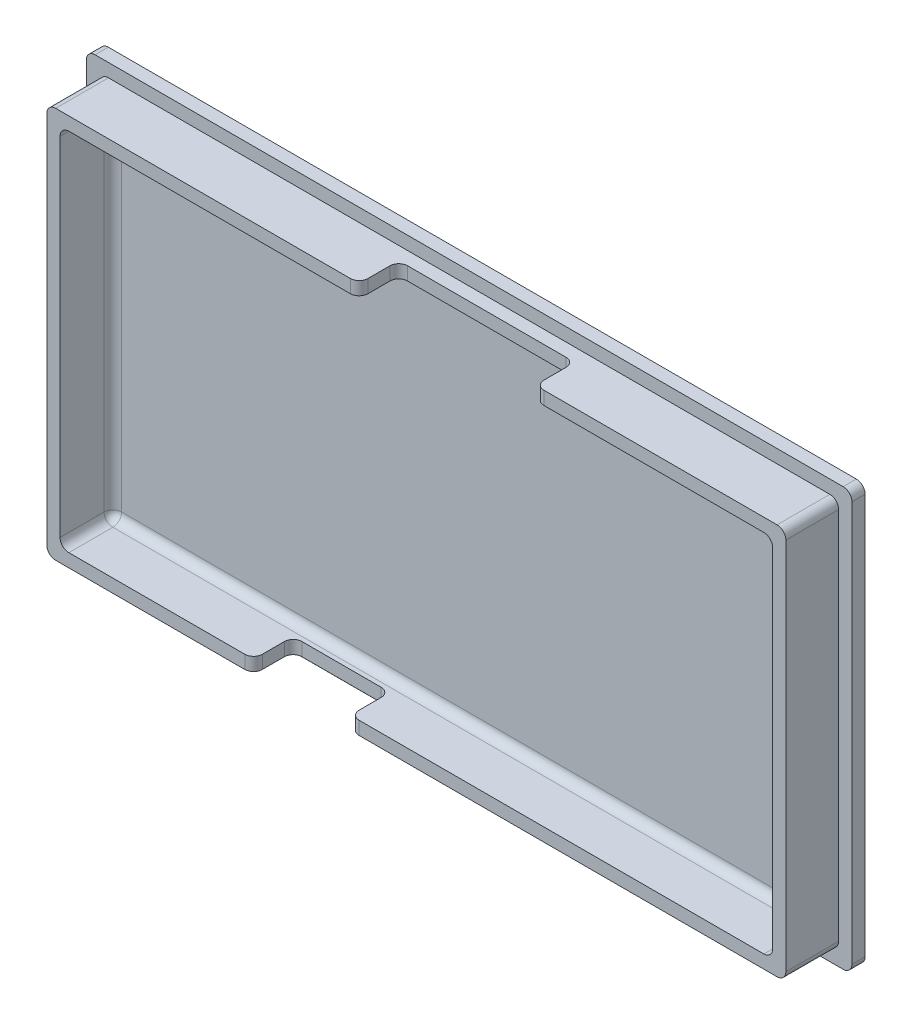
ISO-10303-21;
HEADER;
FILE_DESCRIPTION(('STEP AP214'),'2;1');
FILE_NAME('part.step','',(''),(''),'','','');
FILE_SCHEMA(('AUTOMOTIVE_DESIGN { 1 0 10303 214 1 1 1 1 }'));
ENDSEC;
DATA;
#1=APPLICATION_CONTEXT('core data for automotive mechanical design processes');
#2=APPLICATION_PROTOCOL_DEFINITION('international standard','automotive_design',2000,#1);
#3=PRODUCT_CONTEXT('',#1,'mechanical');
#4=PRODUCT('Part','Part','',(#3));
#5=PRODUCT_RELATED_PRODUCT_CATEGORY('part','',(#4));
#6=PRODUCT_DEFINITION_FORMATION('','',#4);
#7=PRODUCT_DEFINITION_CONTEXT('part definition',#1,'design');
#8=PRODUCT_DEFINITION('design','',#6,#7);
#9=PRODUCT_DEFINITION_SHAPE('','',#8);
#10=(LENGTH_UNIT() NAMED_UNIT(*) SI_UNIT(.MILLI.,.METRE.));
#11=(NAMED_UNIT(*) PLANE_ANGLE_UNIT() SI_UNIT($,.RADIAN.));
#12=(NAMED_UNIT(*) SI_UNIT($,.STERADIAN.) SOLID_ANGLE_UNIT());
#13=UNCERTAINTY_MEASURE_WITH_UNIT(LENGTH_MEASURE(1.E-05),#10,'distance_accuracy_value','');
#14=(GEOMETRIC_REPRESENTATION_CONTEXT(3) GLOBAL_UNCERTAINTY_ASSIGNED_CONTEXT((#13)) GLOBAL_UNIT_ASSIGNED_CONTEXT((#10,
#11,#12)) REPRESENTATION_CONTEXT('',''));
#15=CARTESIAN_POINT('',(0.,0.,0.));
#16=DIRECTION('',(0.,0.,1.));
#17=DIRECTION('',(1.,0.,0.));
#18=AXIS2_PLACEMENT_3D('',#15,#16,#17);
#19=CARTESIAN_POINT('',(0.,0.,7.5));
#20=DIRECTION('',(0.,0.,1.));
#21=DIRECTION('',(1.,0.,0.));
#22=AXIS2_PLACEMENT_3D('',#19,#20,#21);
#23=PLANE('',#22);
#24=DIRECTION('',(1.,0.,0.));
#25=VECTOR('',#24,1.);
#26=CARTESIAN_POINT('',(40.49,-20.74,7.5));
#27=LINE('',#26,#25);
#28=CARTESIAN_POINT('',(-6.49999999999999,-20.74,7.5));
#29=VERTEX_POINT('',#28);
#30=CARTESIAN_POINT('',(39.49,-20.74,7.5));
#31=VERTEX_POINT('',#30);
#32=EDGE_CURVE('E334',#29,#31,#27,.T.);
#33=ORIENTED_EDGE('',*,*,#32,.F.);
#34=DIRECTION('',(0.,1.,0.));
#35=VECTOR('',#34,1.);
#36=CARTESIAN_POINT('',(-6.49999999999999,-22.24,7.5));
#37=LINE('',#36,#35);
#38=CARTESIAN_POINT('',(-6.49999999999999,-22.24,7.5));
#39=VERTEX_POINT('',#38);
#40=EDGE_CURVE('E423',#29,#39,#37,.F.);
#41=ORIENTED_EDGE('',*,*,#40,.T.);
#42=DIRECTION('',(1.,0.,0.));
#43=VECTOR('',#42,1.);
#44=CARTESIAN_POINT('',(41.99,-22.24,7.5));
#45=LINE('',#44,#43);
#46=CARTESIAN_POINT('',(40.99,-22.24,7.5));
#47=VERTEX_POINT('',#46);
#48=EDGE_CURVE('E516',#39,#47,#45,.T.);
#49=ORIENTED_EDGE('',*,*,#48,.T.);
#50=CARTESIAN_POINT('',(40.99,-21.24,7.5));
#51=DIRECTION('',(0.,0.,1.));
#52=DIRECTION('',(1.,0.,0.));
#53=AXIS2_PLACEMENT_3D('',#50,#51,#52);
#54=CIRCLE('',#53,1.);
#55=CARTESIAN_POINT('',(41.99,-21.24,7.5));
#56=VERTEX_POINT('',#55);
#57=EDGE_CURVE('E630',#47,#56,#54,.T.);
#58=ORIENTED_EDGE('',*,*,#57,.T.);
#59=DIRECTION('',(0.,1.,0.));
#60=VECTOR('',#59,1.);
#61=CARTESIAN_POINT('',(41.99,-22.24,7.5));
#62=LINE('',#61,#60);
#63=CARTESIAN_POINT('',(41.99,21.24,7.5));
#64=VERTEX_POINT('',#63);
#65=EDGE_CURVE('E520',#56,#64,#62,.T.);
#66=ORIENTED_EDGE('',*,*,#65,.T.);
#67=CARTESIAN_POINT('',(40.99,21.24,7.5));
#68=DIRECTION('',(0.,0.,1.));
#69=DIRECTION('',(1.,0.,0.));
#70=AXIS2_PLACEMENT_3D('',#67,#68,#69);
#71=CIRCLE('',#70,1.);
#72=CARTESIAN_POINT('',(40.99,22.24,7.5));
#73=VERTEX_POINT('',#72);
#74=EDGE_CURVE('E632',#64,#73,#71,.T.);
#75=ORIENTED_EDGE('',*,*,#74,.T.);
#76=DIRECTION('',(-1.,0.,0.));
#77=VECTOR('',#76,1.);
#78=CARTESIAN_POINT('',(41.99,22.24,7.5));
#79=LINE('',#78,#77);
#80=CARTESIAN_POINT('',(14.5,22.24,7.5));
#81=VERTEX_POINT('',#80);
#82=EDGE_CURVE('E524',#73,#81,#79,.T.);
#83=ORIENTED_EDGE('',*,*,#82,.T.);
#84=DIRECTION('',(0.,1.,0.));
#85=VECTOR('',#84,1.);
#86=CARTESIAN_POINT('',(14.5,20.74,7.5));
#87=LINE('',#86,#85);
#88=CARTESIAN_POINT('',(14.5,20.74,7.5));
#89=VERTEX_POINT('',#88);
#90=EDGE_CURVE('E421',#81,#89,#87,.F.);
#91=ORIENTED_EDGE('',*,*,#90,.T.);
#92=DIRECTION('',(-1.,0.,0.));
#93=VECTOR('',#92,1.);
#94=CARTESIAN_POINT('',(40.49,20.74,7.5));
#95=LINE('',#94,#93);
#96=CARTESIAN_POINT('',(39.49,20.74,7.5));
#97=VERTEX_POINT('',#96);
#98=EDGE_CURVE('E507',#97,#89,#95,.T.);
#99=ORIENTED_EDGE('',*,*,#98,.F.);
#100=CARTESIAN_POINT('',(39.49,19.74,7.5));
#101=DIRECTION('',(0.,0.,1.));
#102=DIRECTION('',(1.,0.,0.));
#103=AXIS2_PLACEMENT_3D('',#100,#101,#102);
#104=CIRCLE('',#103,1.);
#105=CARTESIAN_POINT('',(40.49,19.74,7.5));
#106=VERTEX_POINT('',#105);
#107=EDGE_CURVE('E343',#97,#106,#104,.F.);
#108=ORIENTED_EDGE('',*,*,#107,.T.);
#109=DIRECTION('',(0.,1.,0.));
#110=VECTOR('',#109,1.);
#111=CARTESIAN_POINT('',(40.49,-20.74,7.5));
#112=LINE('',#111,#110);
#113=CARTESIAN_POINT('',(40.49,-19.74,7.5));
#114=VERTEX_POINT('',#113);
#115=EDGE_CURVE('E333',#114,#106,#112,.T.);
#116=ORIENTED_EDGE('',*,*,#115,.F.);
#117=CARTESIAN_POINT('',(39.49,-19.74,7.5));
#118=DIRECTION('',(0.,0.,1.));
#119=DIRECTION('',(1.,0.,0.));
#120=AXIS2_PLACEMENT_3D('',#117,#118,#119);
#121=CIRCLE('',#120,1.);
#122=EDGE_CURVE('E340',#114,#31,#121,.F.);
#123=ORIENTED_EDGE('',*,*,#122,.T.);
#124=EDGE_LOOP('',(#33,#41,#49,#58,#66,#75,#83,#91,#99,#108,#116,#123));
#125=FACE_BOUND('',#124,.T.);
#126=ADVANCED_FACE('F41',(#125),#23,.T.);
#127=CARTESIAN_POINT('',(0.,0.,1.5));
#128=DIRECTION('',(0.,0.,-1.));
#129=DIRECTION('',(-1.,0.,0.));
#130=AXIS2_PLACEMENT_3D('',#127,#128,#129);
#131=PLANE('',#130);
#132=DIRECTION('',(0.,1.,0.));
#133=VECTOR('',#132,1.);
#134=CARTESIAN_POINT('',(43.5,23.75,1.5));
#135=LINE('',#134,#133);
#136=CARTESIAN_POINT('',(43.5,-22.75,1.5));
#137=VERTEX_POINT('',#136);
#138=CARTESIAN_POINT('',(43.5,22.75,1.5));
#139=VERTEX_POINT('',#138);
#140=EDGE_CURVE('E545',#137,#139,#135,.T.);
#141=ORIENTED_EDGE('',*,*,#140,.T.);
#142=CARTESIAN_POINT('',(42.5,22.75,1.5));
#143=DIRECTION('',(0.,0.,-1.));
#144=DIRECTION('',(-1.,0.,0.));
#145=AXIS2_PLACEMENT_3D('',#142,#143,#144);
#146=CIRCLE('',#145,1.);
#147=CARTESIAN_POINT('',(42.5,23.75,1.5));
#148=VERTEX_POINT('',#147);
#149=EDGE_CURVE('E613',#139,#148,#146,.F.);
#150=ORIENTED_EDGE('',*,*,#149,.T.);
#151=DIRECTION('',(-1.,0.,0.));
#152=VECTOR('',#151,1.);
#153=CARTESIAN_POINT('',(43.5,23.75,1.5));
#154=LINE('',#153,#152);
#155=CARTESIAN_POINT('',(-42.5,23.75,1.5));
#156=VERTEX_POINT('',#155);
#157=EDGE_CURVE('E323',#148,#156,#154,.T.);
#158=ORIENTED_EDGE('',*,*,#157,.T.);
#159=CARTESIAN_POINT('',(-42.5,22.75,1.5));
#160=DIRECTION('',(0.,0.,-1.));
#161=DIRECTION('',(-1.,0.,0.));
#162=AXIS2_PLACEMENT_3D('',#159,#160,#161);
#163=CIRCLE('',#162,1.);
#164=CARTESIAN_POINT('',(-43.5,22.75,1.5));
#165=VERTEX_POINT('',#164);
#166=EDGE_CURVE('E607',#156,#165,#163,.F.);
#167=ORIENTED_EDGE('',*,*,#166,.T.);
#168=DIRECTION('',(0.,-1.,0.));
#169=VECTOR('',#168,1.);
#170=CARTESIAN_POINT('',(-43.5,23.75,1.5));
#171=LINE('',#170,#169);
#172=CARTESIAN_POINT('',(-43.5,-22.75,1.5));
#173=VERTEX_POINT('',#172);
#174=EDGE_CURVE('E538',#165,#173,#171,.T.);
#175=ORIENTED_EDGE('',*,*,#174,.T.);
#176=CARTESIAN_POINT('',(-42.5,-22.75,1.5));
#177=DIRECTION('',(0.,0.,-1.));
#178=DIRECTION('',(-1.,0.,0.));
#179=AXIS2_PLACEMENT_3D('',#176,#177,#178);
#180=CIRCLE('',#179,1.);
#181=CARTESIAN_POINT('',(-42.5,-23.75,1.5));
#182=VERTEX_POINT('',#181);
#183=EDGE_CURVE('E609',#173,#182,#180,.F.);
#184=ORIENTED_EDGE('',*,*,#183,.T.);
#185=DIRECTION('',(1.,0.,0.));
#186=VECTOR('',#185,1.);
#187=CARTESIAN_POINT('',(43.5,-23.75,1.5));
#188=LINE('',#187,#186);
#189=CARTESIAN_POINT('',(42.5,-23.75,1.5));
#190=VERTEX_POINT('',#189);
#191=EDGE_CURVE('E541',#182,#190,#188,.T.);
#192=ORIENTED_EDGE('',*,*,#191,.T.);
#193=CARTESIAN_POINT('',(42.5,-22.75,1.5));
#194=DIRECTION('',(0.,0.,-1.));
#195=DIRECTION('',(-1.,0.,0.));
#196=AXIS2_PLACEMENT_3D('',#193,#194,#195);
#197=CIRCLE('',#196,1.);
#198=EDGE_CURVE('E611',#190,#137,#197,.F.);
#199=ORIENTED_EDGE('',*,*,#198,.T.);
#200=EDGE_LOOP('',(#141,#150,#158,#167,#175,#184,#192,#199));
#201=FACE_BOUND('',#200,.T.);
#202=DIRECTION('',(0.,-1.,0.));
#203=VECTOR('',#202,1.);
#204=CARTESIAN_POINT('',(-41.99,-22.24,1.5));
#205=LINE('',#204,#203);
#206=CARTESIAN_POINT('',(-41.99,21.24,1.5));
#207=VERTEX_POINT('',#206);
#208=CARTESIAN_POINT('',(-41.99,-21.24,1.5));
#209=VERTEX_POINT('',#208);
#210=EDGE_CURVE('E509',#207,#209,#205,.T.);
#211=ORIENTED_EDGE('',*,*,#210,.F.);
#212=CARTESIAN_POINT('',(-40.99,21.24,1.5));
#213=DIRECTION('',(0.,0.,-1.));
#214=DIRECTION('',(-1.,0.,0.));
#215=AXIS2_PLACEMENT_3D('',#212,#213,#214);
#216=CIRCLE('',#215,1.);
#217=CARTESIAN_POINT('',(-40.99,22.24,1.5));
#218=VERTEX_POINT('',#217);
#219=EDGE_CURVE('E357',#207,#218,#216,.T.);
#220=ORIENTED_EDGE('',*,*,#219,.T.);
#221=DIRECTION('',(-1.,0.,0.));
#222=VECTOR('',#221,1.);
#223=CARTESIAN_POINT('',(41.99,22.24,1.5));
#224=LINE('',#223,#222);
#225=CARTESIAN_POINT('',(40.99,22.24,1.5));
#226=VERTEX_POINT('',#225);
#227=EDGE_CURVE('E517',#226,#218,#224,.T.);
#228=ORIENTED_EDGE('',*,*,#227,.F.);
#229=CARTESIAN_POINT('',(40.99,21.24,1.5));
#230=DIRECTION('',(0.,0.,-1.));
#231=DIRECTION('',(-1.,0.,0.));
#232=AXIS2_PLACEMENT_3D('',#229,#230,#231);
#233=CIRCLE('',#232,1.);
#234=CARTESIAN_POINT('',(41.99,21.24,1.5));
#235=VERTEX_POINT('',#234);
#236=EDGE_CURVE('E351',#226,#235,#233,.T.);
#237=ORIENTED_EDGE('',*,*,#236,.T.);
#238=DIRECTION('',(0.,1.,0.));
#239=VECTOR('',#238,1.);
#240=CARTESIAN_POINT('',(41.99,-22.24,1.5));
#241=LINE('',#240,#239);
#242=CARTESIAN_POINT('',(41.99,-21.24,1.5));
#243=VERTEX_POINT('',#242);
#244=EDGE_CURVE('E533',#243,#235,#241,.T.);
#245=ORIENTED_EDGE('',*,*,#244,.F.);
#246=CARTESIAN_POINT('',(40.99,-21.24,1.5));
#247=DIRECTION('',(0.,0.,-1.));
#248=DIRECTION('',(-1.,0.,0.));
#249=AXIS2_PLACEMENT_3D('',#246,#247,#248);
#250=CIRCLE('',#249,1.);
#251=CARTESIAN_POINT('',(40.99,-22.24,1.5));
#252=VERTEX_POINT('',#251);
#253=EDGE_CURVE('E353',#243,#252,#250,.T.);
#254=ORIENTED_EDGE('',*,*,#253,.T.);
#255=DIRECTION('',(1.,0.,0.));
#256=VECTOR('',#255,1.);
#257=CARTESIAN_POINT('',(41.99,-22.24,1.5));
#258=LINE('',#257,#256);
#259=CARTESIAN_POINT('',(-40.99,-22.24,1.5));
#260=VERTEX_POINT('',#259);
#261=EDGE_CURVE('E530',#260,#252,#258,.T.);
#262=ORIENTED_EDGE('',*,*,#261,.F.);
#263=CARTESIAN_POINT('',(-40.99,-21.24,1.5));
#264=DIRECTION('',(0.,0.,-1.));
#265=DIRECTION('',(-1.,0.,0.));
#266=AXIS2_PLACEMENT_3D('',#263,#264,#265);
#267=CIRCLE('',#266,1.);
#268=EDGE_CURVE('E355',#260,#209,#267,.T.);
#269=ORIENTED_EDGE('',*,*,#268,.T.);
#270=EDGE_LOOP('',(#211,#220,#228,#237,#245,#254,#262,#269));
#271=FACE_BOUND('',#270,.T.);
#272=ADVANCED_FACE('F661',(#201,#271),#131,.F.);
#273=CARTESIAN_POINT('',(-43.5,23.75,1.5));
#274=DIRECTION('',(1.,0.,0.));
#275=DIRECTION('',(0.,1.,0.));
#276=AXIS2_PLACEMENT_3D('',#273,#274,#275);
#277=PLANE('',#276);
#278=DIRECTION('',(0.,-1.,0.));
#279=VECTOR('',#278,1.);
#280=CARTESIAN_POINT('',(-43.5,23.75,0.));
#281=LINE('',#280,#279);
#282=CARTESIAN_POINT('',(-43.5,22.75,0.));
#283=VERTEX_POINT('',#282);
#284=CARTESIAN_POINT('',(-43.5,-22.75,0.));
#285=VERTEX_POINT('',#284);
#286=EDGE_CURVE('E527',#283,#285,#281,.T.);
#287=ORIENTED_EDGE('',*,*,#286,.T.);
#288=DIRECTION('',(0.,0.,-1.));
#289=VECTOR('',#288,1.);
#290=CARTESIAN_POINT('',(-43.5,-22.75,1.5));
#291=LINE('',#290,#289);
#292=EDGE_CURVE('E346',#285,#173,#291,.F.);
#293=ORIENTED_EDGE('',*,*,#292,.T.);
#294=ORIENTED_EDGE('',*,*,#174,.F.);
#295=DIRECTION('',(0.,0.,-1.));
#296=VECTOR('',#295,1.);
#297=CARTESIAN_POINT('',(-43.5,22.75,1.5));
#298=LINE('',#297,#296);
#299=EDGE_CURVE('E650',#165,#283,#298,.T.);
#300=ORIENTED_EDGE('',*,*,#299,.T.);
#301=EDGE_LOOP('',(#287,#293,#294,#300));
#302=FACE_BOUND('',#301,.T.);
#303=ADVANCED_FACE('F655',(#302),#277,.F.);
#304=CARTESIAN_POINT('',(43.5,-23.75,1.5));
#305=DIRECTION('',(0.,1.,0.));
#306=DIRECTION('',(-1.,0.,0.));
#307=AXIS2_PLACEMENT_3D('',#304,#305,#306);
#308=PLANE('',#307);
#309=DIRECTION('',(1.,0.,0.));
#310=VECTOR('',#309,1.);
#311=CARTESIAN_POINT('',(43.5,-23.75,0.));
#312=LINE('',#311,#310);
#313=CARTESIAN_POINT('',(-42.5,-23.75,0.));
#314=VERTEX_POINT('',#313);
#315=CARTESIAN_POINT('',(42.5,-23.75,0.));
#316=VERTEX_POINT('',#315);
#317=EDGE_CURVE('E552',#314,#316,#312,.T.);
#318=ORIENTED_EDGE('',*,*,#317,.T.);
#319=DIRECTION('',(0.,0.,-1.));
#320=VECTOR('',#319,1.);
#321=CARTESIAN_POINT('',(42.5,-23.75,1.5));
#322=LINE('',#321,#320);
#323=EDGE_CURVE('E637',#316,#190,#322,.F.);
#324=ORIENTED_EDGE('',*,*,#323,.T.);
#325=ORIENTED_EDGE('',*,*,#191,.F.);
#326=DIRECTION('',(0.,0.,-1.));
#327=VECTOR('',#326,1.);
#328=CARTESIAN_POINT('',(-42.5,-23.75,1.5));
#329=LINE('',#328,#327);
#330=EDGE_CURVE('E634',#182,#314,#329,.T.);
#331=ORIENTED_EDGE('',*,*,#330,.T.);
#332=EDGE_LOOP('',(#318,#324,#325,#331));
#333=FACE_BOUND('',#332,.T.);
#334=ADVANCED_FACE('F669',(#333),#308,.F.);
#335=CARTESIAN_POINT('',(43.5,23.75,1.5));
#336=DIRECTION('',(-1.,0.,0.));
#337=DIRECTION('',(0.,-1.,0.));
#338=AXIS2_PLACEMENT_3D('',#335,#336,#337);
#339=PLANE('',#338);
#340=DIRECTION('',(0.,1.,0.));
#341=VECTOR('',#340,1.);
#342=CARTESIAN_POINT('',(43.5,23.75,0.));
#343=LINE('',#342,#341);
#344=CARTESIAN_POINT('',(43.5,-22.75,0.));
#345=VERTEX_POINT('',#344);
#346=CARTESIAN_POINT('',(43.5,22.75,0.));
#347=VERTEX_POINT('',#346);
#348=EDGE_CURVE('E555',#345,#347,#343,.T.);
#349=ORIENTED_EDGE('',*,*,#348,.T.);
#350=DIRECTION('',(0.,0.,-1.));
#351=VECTOR('',#350,1.);
#352=CARTESIAN_POINT('',(43.5,22.75,1.5));
#353=LINE('',#352,#351);
#354=EDGE_CURVE('E605',#347,#139,#353,.F.);
#355=ORIENTED_EDGE('',*,*,#354,.T.);
#356=ORIENTED_EDGE('',*,*,#140,.F.);
#357=DIRECTION('',(0.,0.,-1.));
#358=VECTOR('',#357,1.);
#359=CARTESIAN_POINT('',(43.5,-22.75,1.5));
#360=LINE('',#359,#358);
#361=EDGE_CURVE('E602',#137,#345,#360,.T.);
#362=ORIENTED_EDGE('',*,*,#361,.T.);
#363=EDGE_LOOP('',(#349,#355,#356,#362));
#364=FACE_BOUND('',#363,.T.);
#365=ADVANCED_FACE('F681',(#364),#339,.F.);
#366=CARTESIAN_POINT('',(43.5,23.75,1.5));
#367=DIRECTION('',(0.,-1.,0.));
#368=DIRECTION('',(1.,0.,0.));
#369=AXIS2_PLACEMENT_3D('',#366,#367,#368);
#370=PLANE('',#369);
#371=ORIENTED_EDGE('',*,*,#157,.F.);
#372=DIRECTION('',(0.,0.,-1.));
#373=VECTOR('',#372,1.);
#374=CARTESIAN_POINT('',(42.5,23.75,1.5));
#375=LINE('',#374,#373);
#376=CARTESIAN_POINT('',(42.5,23.75,0.));
#377=VERTEX_POINT('',#376);
#378=EDGE_CURVE('E591',#148,#377,#375,.T.);
#379=ORIENTED_EDGE('',*,*,#378,.T.);
#380=DIRECTION('',(-1.,0.,0.));
#381=VECTOR('',#380,1.);
#382=CARTESIAN_POINT('',(43.5,23.75,0.));
#383=LINE('',#382,#381);
#384=CARTESIAN_POINT('',(-42.5,23.75,0.));
#385=VERTEX_POINT('',#384);
#386=EDGE_CURVE('E542',#377,#385,#383,.T.);
#387=ORIENTED_EDGE('',*,*,#386,.T.);
#388=DIRECTION('',(0.,0.,-1.));
#389=VECTOR('',#388,1.);
#390=CARTESIAN_POINT('',(-42.5,23.75,1.5));
#391=LINE('',#390,#389);
#392=EDGE_CURVE('E589',#385,#156,#391,.F.);
#393=ORIENTED_EDGE('',*,*,#392,.T.);
#394=EDGE_LOOP('',(#371,#379,#387,#393));
#395=FACE_BOUND('',#394,.T.);
#396=ADVANCED_FACE('F689',(#395),#370,.F.);
#397=CARTESIAN_POINT('',(0.,0.,0.));
#398=DIRECTION('',(0.,0.,-1.));
#399=DIRECTION('',(-1.,0.,0.));
#400=AXIS2_PLACEMENT_3D('',#397,#398,#399);
#401=PLANE('',#400);
#402=ORIENTED_EDGE('',*,*,#386,.F.);
#403=CARTESIAN_POINT('',(42.5,22.75,0.));
#404=DIRECTION('',(0.,0.,-1.));
#405=DIRECTION('',(-1.,0.,0.));
#406=AXIS2_PLACEMENT_3D('',#403,#404,#405);
#407=CIRCLE('',#406,1.);
#408=EDGE_CURVE('E600',#377,#347,#407,.T.);
#409=ORIENTED_EDGE('',*,*,#408,.T.);
#410=ORIENTED_EDGE('',*,*,#348,.F.);
#411=CARTESIAN_POINT('',(42.5,-22.75,0.));
#412=DIRECTION('',(0.,0.,-1.));
#413=DIRECTION('',(-1.,0.,0.));
#414=AXIS2_PLACEMENT_3D('',#411,#412,#413);
#415=CIRCLE('',#414,1.);
#416=EDGE_CURVE('E598',#345,#316,#415,.T.);
#417=ORIENTED_EDGE('',*,*,#416,.T.);
#418=ORIENTED_EDGE('',*,*,#317,.F.);
#419=CARTESIAN_POINT('',(-42.5,-22.75,0.));
#420=DIRECTION('',(0.,0.,-1.));
#421=DIRECTION('',(-1.,0.,0.));
#422=AXIS2_PLACEMENT_3D('',#419,#420,#421);
#423=CIRCLE('',#422,1.);
#424=EDGE_CURVE('E596',#314,#285,#423,.T.);
#425=ORIENTED_EDGE('',*,*,#424,.T.);
#426=ORIENTED_EDGE('',*,*,#286,.F.);
#427=CARTESIAN_POINT('',(-42.5,22.75,0.));
#428=DIRECTION('',(0.,0.,-1.));
#429=DIRECTION('',(-1.,0.,0.));
#430=AXIS2_PLACEMENT_3D('',#427,#428,#429);
#431=CIRCLE('',#430,1.);
#432=EDGE_CURVE('E594',#283,#385,#431,.T.);
#433=ORIENTED_EDGE('',*,*,#432,.T.);
#434=EDGE_LOOP('',(#402,#409,#410,#417,#418,#425,#426,#433));
#435=FACE_BOUND('',#434,.T.);
#436=ADVANCED_FACE('F673',(#435),#401,.T.);
#437=CARTESIAN_POINT('',(-40.99,-22.24,7.5));
#438=VERTEX_POINT('',#437);
#439=CARTESIAN_POINT('',(-19.5,-22.24,7.5));
#440=VERTEX_POINT('',#439);
#441=EDGE_CURVE('E518',#438,#440,#45,.T.);
#442=ORIENTED_EDGE('',*,*,#441,.T.);
#443=DIRECTION('',(0.,-1.,0.));
#444=VECTOR('',#443,1.);
#445=CARTESIAN_POINT('',(-19.5,-20.74,7.5));
#446=LINE('',#445,#444);
#447=CARTESIAN_POINT('',(-19.5,-20.74,7.5));
#448=VERTEX_POINT('',#447);
#449=EDGE_CURVE('E332',#440,#448,#446,.F.);
#450=ORIENTED_EDGE('',*,*,#449,.T.);
#451=CARTESIAN_POINT('',(-39.49,-20.74,7.5));
#452=VERTEX_POINT('',#451);
#453=EDGE_CURVE('E314',#452,#448,#27,.T.);
#454=ORIENTED_EDGE('',*,*,#453,.F.);
#455=CARTESIAN_POINT('',(-39.49,-19.74,7.5));
#456=DIRECTION('',(0.,0.,1.));
#457=DIRECTION('',(1.,0.,0.));
#458=AXIS2_PLACEMENT_3D('',#455,#456,#457);
#459=CIRCLE('',#458,1.);
#460=CARTESIAN_POINT('',(-40.49,-19.74,7.5));
#461=VERTEX_POINT('',#460);
#462=EDGE_CURVE('E329',#452,#461,#459,.F.);
#463=ORIENTED_EDGE('',*,*,#462,.T.);
#464=DIRECTION('',(0.,-1.,0.));
#465=VECTOR('',#464,1.);
#466=CARTESIAN_POINT('',(-40.49,-20.74,7.5));
#467=LINE('',#466,#465);
#468=CARTESIAN_POINT('',(-40.49,19.74,7.5));
#469=VERTEX_POINT('',#468);
#470=EDGE_CURVE('E394',#469,#461,#467,.T.);
#471=ORIENTED_EDGE('',*,*,#470,.F.);
#472=CARTESIAN_POINT('',(-39.49,19.74,7.5));
#473=DIRECTION('',(0.,0.,1.));
#474=DIRECTION('',(1.,0.,0.));
#475=AXIS2_PLACEMENT_3D('',#472,#473,#474);
#476=CIRCLE('',#475,1.);
#477=CARTESIAN_POINT('',(-39.49,20.74,7.5));
#478=VERTEX_POINT('',#477);
#479=EDGE_CURVE('E339',#469,#478,#476,.F.);
#480=ORIENTED_EDGE('',*,*,#479,.T.);
#481=CARTESIAN_POINT('',(-7.50000000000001,20.74,7.5));
#482=VERTEX_POINT('',#481);
#483=EDGE_CURVE('E503',#482,#478,#95,.T.);
#484=ORIENTED_EDGE('',*,*,#483,.F.);
#485=DIRECTION('',(0.,-1.,0.));
#486=VECTOR('',#485,1.);
#487=CARTESIAN_POINT('',(-7.5,22.24,7.5));
#488=LINE('',#487,#486);
#489=CARTESIAN_POINT('',(-7.50000000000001,22.24,7.5));
#490=VERTEX_POINT('',#489);
#491=EDGE_CURVE('E440',#482,#490,#488,.F.);
#492=ORIENTED_EDGE('',*,*,#491,.T.);
#493=CARTESIAN_POINT('',(-40.99,22.24,7.5));
#494=VERTEX_POINT('',#493);
#495=EDGE_CURVE('E523',#490,#494,#79,.T.);
#496=ORIENTED_EDGE('',*,*,#495,.T.);
#497=CARTESIAN_POINT('',(-40.99,21.24,7.5));
#498=DIRECTION('',(0.,0.,1.));
#499=DIRECTION('',(1.,0.,0.));
#500=AXIS2_PLACEMENT_3D('',#497,#498,#499);
#501=CIRCLE('',#500,1.);
#502=CARTESIAN_POINT('',(-41.99,21.24,7.5));
#503=VERTEX_POINT('',#502);
#504=EDGE_CURVE('E626',#494,#503,#501,.T.);
#505=ORIENTED_EDGE('',*,*,#504,.T.);
#506=DIRECTION('',(0.,-1.,0.));
#507=VECTOR('',#506,1.);
#508=CARTESIAN_POINT('',(-41.99,-22.24,7.5));
#509=LINE('',#508,#507);
#510=CARTESIAN_POINT('',(-41.99,-21.24,7.5));
#511=VERTEX_POINT('',#510);
#512=EDGE_CURVE('E513',#503,#511,#509,.T.);
#513=ORIENTED_EDGE('',*,*,#512,.T.);
#514=CARTESIAN_POINT('',(-40.99,-21.24,7.5));
#515=DIRECTION('',(0.,0.,1.));
#516=DIRECTION('',(1.,0.,0.));
#517=AXIS2_PLACEMENT_3D('',#514,#515,#516);
#518=CIRCLE('',#517,1.);
#519=EDGE_CURVE('E628',#511,#438,#518,.T.);
#520=ORIENTED_EDGE('',*,*,#519,.T.);
#521=EDGE_LOOP('',(#442,#450,#454,#463,#471,#480,#484,#492,#496,#505,#513,#520));
#522=FACE_BOUND('',#521,.T.);
#523=ADVANCED_FACE('F327',(#522),#23,.T.);
#524=CARTESIAN_POINT('',(-41.99,-22.24,7.5));
#525=DIRECTION('',(1.,0.,0.));
#526=DIRECTION('',(0.,0.,-1.));
#527=AXIS2_PLACEMENT_3D('',#524,#525,#526);
#528=PLANE('',#527);
#529=ORIENTED_EDGE('',*,*,#210,.T.);
#530=DIRECTION('',(0.,0.,-1.));
#531=VECTOR('',#530,1.);
#532=CARTESIAN_POINT('',(-41.99,-21.24,7.5));
#533=LINE('',#532,#531);
#534=EDGE_CURVE('E648',#209,#511,#533,.F.);
#535=ORIENTED_EDGE('',*,*,#534,.T.);
#536=ORIENTED_EDGE('',*,*,#512,.F.);
#537=DIRECTION('',(0.,0.,-1.));
#538=VECTOR('',#537,1.);
#539=CARTESIAN_POINT('',(-41.99,21.24,7.5));
#540=LINE('',#539,#538);
#541=EDGE_CURVE('E645',#503,#207,#540,.T.);
#542=ORIENTED_EDGE('',*,*,#541,.T.);
#543=EDGE_LOOP('',(#529,#535,#536,#542));
#544=FACE_BOUND('',#543,.T.);
#545=ADVANCED_FACE('F718',(#544),#528,.F.);
#546=CARTESIAN_POINT('',(41.99,-22.24,7.5));
#547=DIRECTION('',(0.,1.,0.));
#548=DIRECTION('',(0.,0.,1.));
#549=AXIS2_PLACEMENT_3D('',#546,#547,#548);
#550=PLANE('',#549);
#551=ORIENTED_EDGE('',*,*,#48,.F.);
#552=CARTESIAN_POINT('',(-6.49999999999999,-22.24,6.5));
#553=DIRECTION('',(0.,1.,0.));
#554=DIRECTION('',(0.,0.,1.));
#555=AXIS2_PLACEMENT_3D('',#552,#553,#554);
#556=CIRCLE('',#555,1.);
#557=CARTESIAN_POINT('',(-7.49999999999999,-22.24,6.5));
#558=VERTEX_POINT('',#557);
#559=EDGE_CURVE('E427',#39,#558,#556,.F.);
#560=ORIENTED_EDGE('',*,*,#559,.T.);
#561=DIRECTION('',(0.,0.,-1.));
#562=VECTOR('',#561,1.);
#563=CARTESIAN_POINT('',(-7.49999999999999,-22.24,7.5));
#564=LINE('',#563,#562);
#565=CARTESIAN_POINT('',(-7.49999999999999,-22.24,4.));
#566=VERTEX_POINT('',#565);
#567=EDGE_CURVE('E363',#558,#566,#564,.T.);
#568=ORIENTED_EDGE('',*,*,#567,.T.);
#569=CARTESIAN_POINT('',(-8.49999999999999,-22.24,4.));
#570=DIRECTION('',(0.,1.,0.));
#571=DIRECTION('',(0.,0.,1.));
#572=AXIS2_PLACEMENT_3D('',#569,#570,#571);
#573=CIRCLE('',#572,1.);
#574=CARTESIAN_POINT('',(-8.49999999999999,-22.24,3.));
#575=VERTEX_POINT('',#574);
#576=EDGE_CURVE('E467',#566,#575,#573,.T.);
#577=ORIENTED_EDGE('',*,*,#576,.T.);
#578=DIRECTION('',(1.,0.,0.));
#579=VECTOR('',#578,1.);
#580=CARTESIAN_POINT('',(41.99,-22.24,3.));
#581=LINE('',#580,#579);
#582=CARTESIAN_POINT('',(-17.5,-22.24,3.));
#583=VERTEX_POINT('',#582);
#584=EDGE_CURVE('E954',#583,#575,#581,.T.);
#585=ORIENTED_EDGE('',*,*,#584,.F.);
#586=CARTESIAN_POINT('',(-17.5,-22.24,4.));
#587=DIRECTION('',(0.,1.,0.));
#588=DIRECTION('',(0.,0.,1.));
#589=AXIS2_PLACEMENT_3D('',#586,#587,#588);
#590=CIRCLE('',#589,1.);
#591=CARTESIAN_POINT('',(-18.5,-22.24,4.));
#592=VERTEX_POINT('',#591);
#593=EDGE_CURVE('E469',#583,#592,#590,.T.);
#594=ORIENTED_EDGE('',*,*,#593,.T.);
#595=DIRECTION('',(0.,0.,1.));
#596=VECTOR('',#595,1.);
#597=CARTESIAN_POINT('',(-18.5,-22.24,7.5));
#598=LINE('',#597,#596);
#599=CARTESIAN_POINT('',(-18.5,-22.24,6.5));
#600=VERTEX_POINT('',#599);
#601=EDGE_CURVE('E957',#592,#600,#598,.T.);
#602=ORIENTED_EDGE('',*,*,#601,.T.);
#603=CARTESIAN_POINT('',(-19.5,-22.24,6.5));
#604=DIRECTION('',(0.,1.,0.));
#605=DIRECTION('',(0.,0.,1.));
#606=AXIS2_PLACEMENT_3D('',#603,#604,#605);
#607=CIRCLE('',#606,1.);
#608=EDGE_CURVE('E425',#600,#440,#607,.F.);
#609=ORIENTED_EDGE('',*,*,#608,.T.);
#610=ORIENTED_EDGE('',*,*,#441,.F.);
#611=DIRECTION('',(0.,0.,-1.));
#612=VECTOR('',#611,1.);
#613=CARTESIAN_POINT('',(-40.99,-22.24,7.5));
#614=LINE('',#613,#612);
#615=EDGE_CURVE('E639',#438,#260,#614,.T.);
#616=ORIENTED_EDGE('',*,*,#615,.T.);
#617=ORIENTED_EDGE('',*,*,#261,.T.);
#618=DIRECTION('',(0.,0.,-1.));
#619=VECTOR('',#618,1.);
#620=CARTESIAN_POINT('',(40.99,-22.24,7.5));
#621=LINE('',#620,#619);
#622=EDGE_CURVE('E642',#252,#47,#621,.F.);
#623=ORIENTED_EDGE('',*,*,#622,.T.);
#624=EDGE_LOOP('',(#551,#560,#568,#577,#585,#594,#602,#609,#610,#616,#617,#623));
#625=FACE_BOUND('',#624,.T.);
#626=ADVANCED_FACE('F723',(#625),#550,.F.);
#627=CARTESIAN_POINT('',(41.99,-22.24,7.5));
#628=DIRECTION('',(-1.,0.,0.));
#629=DIRECTION('',(0.,0.,1.));
#630=AXIS2_PLACEMENT_3D('',#627,#628,#629);
#631=PLANE('',#630);
#632=ORIENTED_EDGE('',*,*,#244,.T.);
#633=DIRECTION('',(0.,0.,-1.));
#634=VECTOR('',#633,1.);
#635=CARTESIAN_POINT('',(41.99,21.24,7.5));
#636=LINE('',#635,#634);
#637=EDGE_CURVE('E624',#235,#64,#636,.F.);
#638=ORIENTED_EDGE('',*,*,#637,.T.);
#639=ORIENTED_EDGE('',*,*,#65,.F.);
#640=DIRECTION('',(0.,0.,-1.));
#641=VECTOR('',#640,1.);
#642=CARTESIAN_POINT('',(41.99,-21.24,7.5));
#643=LINE('',#642,#641);
#644=EDGE_CURVE('E621',#56,#243,#643,.T.);
#645=ORIENTED_EDGE('',*,*,#644,.T.);
#646=EDGE_LOOP('',(#632,#638,#639,#645));
#647=FACE_BOUND('',#646,.T.);
#648=ADVANCED_FACE('F1012',(#647),#631,.F.);
#649=CARTESIAN_POINT('',(41.99,22.24,7.5));
#650=DIRECTION('',(0.,-1.,0.));
#651=DIRECTION('',(0.,0.,-1.));
#652=AXIS2_PLACEMENT_3D('',#649,#650,#651);
#653=PLANE('',#652);
#654=DIRECTION('',(0.,0.,1.));
#655=VECTOR('',#654,1.);
#656=CARTESIAN_POINT('',(13.5,22.24,7.5));
#657=LINE('',#656,#655);
#658=CARTESIAN_POINT('',(13.5,22.24,4.));
#659=VERTEX_POINT('',#658);
#660=CARTESIAN_POINT('',(13.5,22.24,6.5));
#661=VERTEX_POINT('',#660);
#662=EDGE_CURVE('E953',#659,#661,#657,.T.);
#663=ORIENTED_EDGE('',*,*,#662,.T.);
#664=CARTESIAN_POINT('',(14.5,22.24,6.5));
#665=DIRECTION('',(0.,-1.,0.));
#666=DIRECTION('',(0.,0.,-1.));
#667=AXIS2_PLACEMENT_3D('',#664,#665,#666);
#668=CIRCLE('',#667,1.);
#669=EDGE_CURVE('E56',#661,#81,#668,.F.);
#670=ORIENTED_EDGE('',*,*,#669,.T.);
#671=ORIENTED_EDGE('',*,*,#82,.F.);
#672=DIRECTION('',(0.,0.,-1.));
#673=VECTOR('',#672,1.);
#674=CARTESIAN_POINT('',(40.99,22.24,7.5));
#675=LINE('',#674,#673);
#676=EDGE_CURVE('E618',#73,#226,#675,.T.);
#677=ORIENTED_EDGE('',*,*,#676,.T.);
#678=ORIENTED_EDGE('',*,*,#227,.T.);
#679=DIRECTION('',(0.,0.,-1.));
#680=VECTOR('',#679,1.);
#681=CARTESIAN_POINT('',(-40.99,22.24,7.5));
#682=LINE('',#681,#680);
#683=EDGE_CURVE('E615',#218,#494,#682,.F.);
#684=ORIENTED_EDGE('',*,*,#683,.T.);
#685=ORIENTED_EDGE('',*,*,#495,.F.);
#686=CARTESIAN_POINT('',(-7.5,22.24,6.5));
#687=DIRECTION('',(0.,-1.,0.));
#688=DIRECTION('',(0.,0.,-1.));
#689=AXIS2_PLACEMENT_3D('',#686,#687,#688);
#690=CIRCLE('',#689,1.);
#691=CARTESIAN_POINT('',(-6.50000000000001,22.24,6.5));
#692=VERTEX_POINT('',#691);
#693=EDGE_CURVE('E458',#490,#692,#690,.F.);
#694=ORIENTED_EDGE('',*,*,#693,.T.);
#695=DIRECTION('',(0.,0.,-1.));
#696=VECTOR('',#695,1.);
#697=CARTESIAN_POINT('',(-6.50000000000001,22.24,7.5));
#698=LINE('',#697,#696);
#699=CARTESIAN_POINT('',(-6.50000000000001,22.24,4.));
#700=VERTEX_POINT('',#699);
#701=EDGE_CURVE('E482',#692,#700,#698,.T.);
#702=ORIENTED_EDGE('',*,*,#701,.T.);
#703=CARTESIAN_POINT('',(-5.5,22.24,4.));
#704=DIRECTION('',(0.,-1.,0.));
#705=DIRECTION('',(0.,0.,-1.));
#706=AXIS2_PLACEMENT_3D('',#703,#704,#705);
#707=CIRCLE('',#706,1.);
#708=CARTESIAN_POINT('',(-5.50000000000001,22.24,3.));
#709=VERTEX_POINT('',#708);
#710=EDGE_CURVE('E475',#700,#709,#707,.T.);
#711=ORIENTED_EDGE('',*,*,#710,.T.);
#712=DIRECTION('',(-1.,0.,0.));
#713=VECTOR('',#712,1.);
#714=CARTESIAN_POINT('',(41.99,22.24,3.));
#715=LINE('',#714,#713);
#716=CARTESIAN_POINT('',(12.5,22.24,3.));
#717=VERTEX_POINT('',#716);
#718=EDGE_CURVE('E480',#717,#709,#715,.T.);
#719=ORIENTED_EDGE('',*,*,#718,.F.);
#720=CARTESIAN_POINT('',(12.5,22.24,4.));
#721=DIRECTION('',(0.,-1.,0.));
#722=DIRECTION('',(0.,0.,-1.));
#723=AXIS2_PLACEMENT_3D('',#720,#721,#722);
#724=CIRCLE('',#723,1.);
#725=EDGE_CURVE('E49',#717,#659,#724,.T.);
#726=ORIENTED_EDGE('',*,*,#725,.T.);
#727=EDGE_LOOP('',(#663,#670,#671,#677,#678,#684,#685,#694,#702,#711,#719,#726));
#728=FACE_BOUND('',#727,.T.);
#729=ADVANCED_FACE('F479',(#728),#653,.F.);
#730=CARTESIAN_POINT('',(-40.49,-20.74,7.5));
#731=DIRECTION('',(1.,0.,0.));
#732=DIRECTION('',(0.,0.,-1.));
#733=AXIS2_PLACEMENT_3D('',#730,#731,#732);
#734=PLANE('',#733);
#735=ORIENTED_EDGE('',*,*,#470,.T.);
#736=DIRECTION('',(0.,0.,-1.));
#737=VECTOR('',#736,1.);
#738=CARTESIAN_POINT('',(-40.49,-19.74,1.5));
#739=LINE('',#738,#737);
#740=CARTESIAN_POINT('',(-40.49,-19.74,2.5));
#741=VERTEX_POINT('',#740);
#742=EDGE_CURVE('E338',#461,#741,#739,.T.);
#743=ORIENTED_EDGE('',*,*,#742,.T.);
#744=DIRECTION('',(0.,-1.,0.));
#745=VECTOR('',#744,1.);
#746=CARTESIAN_POINT('',(-40.49,-20.74,2.5));
#747=LINE('',#746,#745);
#748=CARTESIAN_POINT('',(-40.49,19.74,2.5));
#749=VERTEX_POINT('',#748);
#750=EDGE_CURVE('E580',#741,#749,#747,.F.);
#751=ORIENTED_EDGE('',*,*,#750,.T.);
#752=DIRECTION('',(0.,0.,-1.));
#753=VECTOR('',#752,1.);
#754=CARTESIAN_POINT('',(-40.49,19.74,7.5));
#755=LINE('',#754,#753);
#756=EDGE_CURVE('E578',#749,#469,#755,.F.);
#757=ORIENTED_EDGE('',*,*,#756,.T.);
#758=EDGE_LOOP('',(#735,#743,#751,#757));
#759=FACE_BOUND('',#758,.T.);
#760=ADVANCED_FACE('F982',(#759),#734,.T.);
#761=CARTESIAN_POINT('',(40.49,-20.74,7.5));
#762=DIRECTION('',(0.,1.,0.));
#763=DIRECTION('',(0.,0.,1.));
#764=AXIS2_PLACEMENT_3D('',#761,#762,#763);
#765=PLANE('',#764);
#766=DIRECTION('',(0.,0.,-1.));
#767=VECTOR('',#766,1.);
#768=CARTESIAN_POINT('',(-7.49999999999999,-20.74,7.5));
#769=LINE('',#768,#767);
#770=CARTESIAN_POINT('',(-7.49999999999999,-20.74,6.5));
#771=VERTEX_POINT('',#770);
#772=CARTESIAN_POINT('',(-7.49999999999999,-20.74,4.));
#773=VERTEX_POINT('',#772);
#774=EDGE_CURVE('E409',#771,#773,#769,.T.);
#775=ORIENTED_EDGE('',*,*,#774,.F.);
#776=CARTESIAN_POINT('',(-6.49999999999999,-20.74,6.5));
#777=DIRECTION('',(0.,1.,0.));
#778=DIRECTION('',(0.,0.,1.));
#779=AXIS2_PLACEMENT_3D('',#776,#777,#778);
#780=CIRCLE('',#779,1.);
#781=EDGE_CURVE('E419',#771,#29,#780,.T.);
#782=ORIENTED_EDGE('',*,*,#781,.T.);
#783=ORIENTED_EDGE('',*,*,#32,.T.);
#784=DIRECTION('',(0.,0.,-1.));
#785=VECTOR('',#784,1.);
#786=CARTESIAN_POINT('',(39.49,-20.74,1.5));
#787=LINE('',#786,#785);
#788=CARTESIAN_POINT('',(39.49,-20.74,2.5));
#789=VERTEX_POINT('',#788);
#790=EDGE_CURVE('E561',#31,#789,#787,.T.);
#791=ORIENTED_EDGE('',*,*,#790,.T.);
#792=DIRECTION('',(1.,0.,0.));
#793=VECTOR('',#792,1.);
#794=CARTESIAN_POINT('',(40.49,-20.74,2.5));
#795=LINE('',#794,#793);
#796=CARTESIAN_POINT('',(-39.49,-20.74,2.5));
#797=VERTEX_POINT('',#796);
#798=EDGE_CURVE('E318',#789,#797,#795,.F.);
#799=ORIENTED_EDGE('',*,*,#798,.T.);
#800=DIRECTION('',(0.,0.,-1.));
#801=VECTOR('',#800,1.);
#802=CARTESIAN_POINT('',(-39.49,-20.74,7.5));
#803=LINE('',#802,#801);
#804=EDGE_CURVE('E310',#797,#452,#803,.F.);
#805=ORIENTED_EDGE('',*,*,#804,.T.);
#806=ORIENTED_EDGE('',*,*,#453,.T.);
#807=CARTESIAN_POINT('',(-19.5,-20.74,6.5));
#808=DIRECTION('',(0.,1.,0.));
#809=DIRECTION('',(0.,0.,1.));
#810=AXIS2_PLACEMENT_3D('',#807,#808,#809);
#811=CIRCLE('',#810,1.);
#812=CARTESIAN_POINT('',(-18.5,-20.74,6.5));
#813=VERTEX_POINT('',#812);
#814=EDGE_CURVE('E417',#448,#813,#811,.T.);
#815=ORIENTED_EDGE('',*,*,#814,.T.);
#816=DIRECTION('',(0.,0.,1.));
#817=VECTOR('',#816,1.);
#818=CARTESIAN_POINT('',(-18.5,-20.74,7.5));
#819=LINE('',#818,#817);
#820=CARTESIAN_POINT('',(-18.5,-20.74,4.));
#821=VERTEX_POINT('',#820);
#822=EDGE_CURVE('E406',#821,#813,#819,.T.);
#823=ORIENTED_EDGE('',*,*,#822,.F.);
#824=CARTESIAN_POINT('',(-17.5,-20.74,4.));
#825=DIRECTION('',(0.,1.,0.));
#826=DIRECTION('',(0.,0.,1.));
#827=AXIS2_PLACEMENT_3D('',#824,#825,#826);
#828=CIRCLE('',#827,1.);
#829=CARTESIAN_POINT('',(-17.5,-20.74,3.));
#830=VERTEX_POINT('',#829);
#831=EDGE_CURVE('E471',#821,#830,#828,.F.);
#832=ORIENTED_EDGE('',*,*,#831,.T.);
#833=DIRECTION('',(1.,0.,0.));
#834=VECTOR('',#833,1.);
#835=CARTESIAN_POINT('',(40.49,-20.74,3.));
#836=LINE('',#835,#834);
#837=CARTESIAN_POINT('',(-8.49999999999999,-20.74,3.));
#838=VERTEX_POINT('',#837);
#839=EDGE_CURVE('E403',#830,#838,#836,.T.);
#840=ORIENTED_EDGE('',*,*,#839,.T.);
#841=CARTESIAN_POINT('',(-8.49999999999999,-20.74,4.));
#842=DIRECTION('',(0.,1.,0.));
#843=DIRECTION('',(0.,0.,1.));
#844=AXIS2_PLACEMENT_3D('',#841,#842,#843);
#845=CIRCLE('',#844,1.);
#846=EDGE_CURVE('E465',#838,#773,#845,.F.);
#847=ORIENTED_EDGE('',*,*,#846,.T.);
#848=EDGE_LOOP('',(#775,#782,#783,#791,#799,#805,#806,#815,#823,#832,#840,#847));
#849=FACE_BOUND('',#848,.T.);
#850=ADVANCED_FACE('F313',(#849),#765,.T.);
#851=CARTESIAN_POINT('',(40.49,-20.74,7.5));
#852=DIRECTION('',(-1.,0.,0.));
#853=DIRECTION('',(0.,0.,1.));
#854=AXIS2_PLACEMENT_3D('',#851,#852,#853);
#855=PLANE('',#854);
#856=DIRECTION('',(0.,1.,0.));
#857=VECTOR('',#856,1.);
#858=CARTESIAN_POINT('',(40.49,-20.74,2.5));
#859=LINE('',#858,#857);
#860=CARTESIAN_POINT('',(40.49,19.74,2.5));
#861=VERTEX_POINT('',#860);
#862=CARTESIAN_POINT('',(40.49,-19.74,2.5));
#863=VERTEX_POINT('',#862);
#864=EDGE_CURVE('E565',#861,#863,#859,.F.);
#865=ORIENTED_EDGE('',*,*,#864,.T.);
#866=DIRECTION('',(0.,0.,-1.));
#867=VECTOR('',#866,1.);
#868=CARTESIAN_POINT('',(40.49,-19.74,7.5));
#869=LINE('',#868,#867);
#870=EDGE_CURVE('E567',#863,#114,#869,.F.);
#871=ORIENTED_EDGE('',*,*,#870,.T.);
#872=ORIENTED_EDGE('',*,*,#115,.T.);
#873=DIRECTION('',(0.,0.,-1.));
#874=VECTOR('',#873,1.);
#875=CARTESIAN_POINT('',(40.49,19.74,1.5));
#876=LINE('',#875,#874);
#877=EDGE_CURVE('E563',#106,#861,#876,.T.);
#878=ORIENTED_EDGE('',*,*,#877,.T.);
#879=EDGE_LOOP('',(#865,#871,#872,#878));
#880=FACE_BOUND('',#879,.T.);
#881=ADVANCED_FACE('F994',(#880),#855,.T.);
#882=CARTESIAN_POINT('',(40.49,20.74,7.5));
#883=DIRECTION('',(0.,-1.,0.));
#884=DIRECTION('',(0.,0.,-1.));
#885=AXIS2_PLACEMENT_3D('',#882,#883,#884);
#886=PLANE('',#885);
#887=ORIENTED_EDGE('',*,*,#98,.T.);
#888=CARTESIAN_POINT('',(14.5,20.74,6.5));
#889=DIRECTION('',(0.,-1.,0.));
#890=DIRECTION('',(0.,0.,-1.));
#891=AXIS2_PLACEMENT_3D('',#888,#889,#890);
#892=CIRCLE('',#891,1.);
#893=CARTESIAN_POINT('',(13.5,20.74,6.5));
#894=VERTEX_POINT('',#893);
#895=EDGE_CURVE('E463',#89,#894,#892,.T.);
#896=ORIENTED_EDGE('',*,*,#895,.T.);
#897=DIRECTION('',(0.,0.,1.));
#898=VECTOR('',#897,1.);
#899=CARTESIAN_POINT('',(13.5,20.74,7.5));
#900=LINE('',#899,#898);
#901=CARTESIAN_POINT('',(13.5,20.74,4.));
#902=VERTEX_POINT('',#901);
#903=EDGE_CURVE('E400',#902,#894,#900,.T.);
#904=ORIENTED_EDGE('',*,*,#903,.F.);
#905=CARTESIAN_POINT('',(12.5,20.74,4.));
#906=DIRECTION('',(0.,-1.,0.));
#907=DIRECTION('',(0.,0.,-1.));
#908=AXIS2_PLACEMENT_3D('',#905,#906,#907);
#909=CIRCLE('',#908,1.);
#910=CARTESIAN_POINT('',(12.5,20.74,3.));
#911=VERTEX_POINT('',#910);
#912=EDGE_CURVE('E11',#902,#911,#909,.F.);
#913=ORIENTED_EDGE('',*,*,#912,.T.);
#914=DIRECTION('',(-1.,0.,0.));
#915=VECTOR('',#914,1.);
#916=CARTESIAN_POINT('',(40.49,20.74,3.));
#917=LINE('',#916,#915);
#918=CARTESIAN_POINT('',(-5.50000000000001,20.74,3.));
#919=VERTEX_POINT('',#918);
#920=EDGE_CURVE('E359',#911,#919,#917,.T.);
#921=ORIENTED_EDGE('',*,*,#920,.T.);
#922=CARTESIAN_POINT('',(-5.5,20.74,4.));
#923=DIRECTION('',(0.,-1.,0.));
#924=DIRECTION('',(0.,0.,-1.));
#925=AXIS2_PLACEMENT_3D('',#922,#923,#924);
#926=CIRCLE('',#925,1.);
#927=CARTESIAN_POINT('',(-6.50000000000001,20.74,4.));
#928=VERTEX_POINT('',#927);
#929=EDGE_CURVE('E473',#919,#928,#926,.F.);
#930=ORIENTED_EDGE('',*,*,#929,.T.);
#931=DIRECTION('',(0.,0.,-1.));
#932=VECTOR('',#931,1.);
#933=CARTESIAN_POINT('',(-6.50000000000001,20.74,7.5));
#934=LINE('',#933,#932);
#935=CARTESIAN_POINT('',(-6.50000000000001,20.74,6.5));
#936=VERTEX_POINT('',#935);
#937=EDGE_CURVE('E397',#936,#928,#934,.T.);
#938=ORIENTED_EDGE('',*,*,#937,.F.);
#939=CARTESIAN_POINT('',(-7.5,20.74,6.5));
#940=DIRECTION('',(0.,-1.,0.));
#941=DIRECTION('',(0.,0.,-1.));
#942=AXIS2_PLACEMENT_3D('',#939,#940,#941);
#943=CIRCLE('',#942,1.);
#944=EDGE_CURVE('E461',#936,#482,#943,.T.);
#945=ORIENTED_EDGE('',*,*,#944,.T.);
#946=ORIENTED_EDGE('',*,*,#483,.T.);
#947=DIRECTION('',(0.,0.,-1.));
#948=VECTOR('',#947,1.);
#949=CARTESIAN_POINT('',(-39.49,20.74,1.5));
#950=LINE('',#949,#948);
#951=CARTESIAN_POINT('',(-39.49,20.74,2.5));
#952=VERTEX_POINT('',#951);
#953=EDGE_CURVE('E587',#478,#952,#950,.T.);
#954=ORIENTED_EDGE('',*,*,#953,.T.);
#955=DIRECTION('',(-1.,0.,0.));
#956=VECTOR('',#955,1.);
#957=CARTESIAN_POINT('',(40.49,20.74,2.5));
#958=LINE('',#957,#956);
#959=CARTESIAN_POINT('',(39.49,20.74,2.5));
#960=VERTEX_POINT('',#959);
#961=EDGE_CURVE('E585',#952,#960,#958,.F.);
#962=ORIENTED_EDGE('',*,*,#961,.T.);
#963=DIRECTION('',(0.,0.,-1.));
#964=VECTOR('',#963,1.);
#965=CARTESIAN_POINT('',(39.49,20.74,7.5));
#966=LINE('',#965,#964);
#967=EDGE_CURVE('E583',#960,#97,#966,.F.);
#968=ORIENTED_EDGE('',*,*,#967,.T.);
#969=EDGE_LOOP('',(#887,#896,#904,#913,#921,#930,#938,#945,#946,#954,#962,#968));
#970=FACE_BOUND('',#969,.T.);
#971=ADVANCED_FACE('F495',(#970),#886,.T.);
#972=DIRECTION('',(0.,-1.,0.));
#973=VECTOR('',#972,1.);
#974=CARTESIAN_POINT('',(-39.49,0.,1.5));
#975=LINE('',#974,#973);
#976=CARTESIAN_POINT('',(-39.49,19.74,1.5));
#977=VERTEX_POINT('',#976);
#978=CARTESIAN_POINT('',(-39.49,-19.74,1.5));
#979=VERTEX_POINT('',#978);
#980=EDGE_CURVE('E573',#977,#979,#975,.T.);
#981=ORIENTED_EDGE('',*,*,#980,.T.);
#982=DIRECTION('',(1.,0.,0.));
#983=VECTOR('',#982,1.);
#984=CARTESIAN_POINT('',(0.,-19.74,1.5));
#985=LINE('',#984,#983);
#986=CARTESIAN_POINT('',(39.49,-19.74,1.5));
#987=VERTEX_POINT('',#986);
#988=EDGE_CURVE('E575',#979,#987,#985,.T.);
#989=ORIENTED_EDGE('',*,*,#988,.T.);
#990=DIRECTION('',(0.,1.,0.));
#991=VECTOR('',#990,1.);
#992=CARTESIAN_POINT('',(39.49,0.,1.5));
#993=LINE('',#992,#991);
#994=CARTESIAN_POINT('',(39.49,19.74,1.5));
#995=VERTEX_POINT('',#994);
#996=EDGE_CURVE('E569',#987,#995,#993,.T.);
#997=ORIENTED_EDGE('',*,*,#996,.T.);
#998=DIRECTION('',(-1.,0.,0.));
#999=VECTOR('',#998,1.);
#1000=CARTESIAN_POINT('',(0.,19.74,1.5));
#1001=LINE('',#1000,#999);
#1002=EDGE_CURVE('E571',#995,#977,#1001,.T.);
#1003=ORIENTED_EDGE('',*,*,#1002,.T.);
#1004=EDGE_LOOP('',(#981,#989,#997,#1003));
#1005=FACE_BOUND('',#1004,.T.);
#1006=ADVANCED_FACE('F714',(#1005),#131,.F.);
#1007=CARTESIAN_POINT('',(-39.49,19.74,7.5));
#1008=DIRECTION('',(0.,0.,1.));
#1009=DIRECTION('',(1.,0.,0.));
#1010=AXIS2_PLACEMENT_3D('',#1007,#1008,#1009);
#1011=CYLINDRICAL_SURFACE('',#1010,1.);
#1012=CARTESIAN_POINT('',(-39.49,19.74,2.5));
#1013=DIRECTION('',(0.,0.,1.));
#1014=DIRECTION('',(1.,0.,0.));
#1015=AXIS2_PLACEMENT_3D('',#1012,#1013,#1014);
#1016=CIRCLE('',#1015,1.);
#1017=EDGE_CURVE('E391',#952,#749,#1016,.T.);
#1018=ORIENTED_EDGE('',*,*,#1017,.F.);
#1019=ORIENTED_EDGE('',*,*,#953,.F.);
#1020=ORIENTED_EDGE('',*,*,#479,.F.);
#1021=ORIENTED_EDGE('',*,*,#756,.F.);
#1022=EDGE_LOOP('',(#1018,#1019,#1020,#1021));
#1023=FACE_BOUND('',#1022,.T.);
#1024=ADVANCED_FACE('F780',(#1023),#1011,.F.);
#1025=CARTESIAN_POINT('',(-39.49,19.74,2.5));
#1026=DIRECTION('',(-1.,0.,0.));
#1027=DIRECTION('',(0.,0.,1.));
#1028=AXIS2_PLACEMENT_3D('',#1025,#1026,#1027);
#1029=SPHERICAL_SURFACE('',#1028,1.);
#1030=CARTESIAN_POINT('',(-39.49,19.74,2.5));
#1031=DIRECTION('',(1.,0.,0.));
#1032=DIRECTION('',(0.,1.,0.));
#1033=AXIS2_PLACEMENT_3D('',#1030,#1031,#1032);
#1034=CIRCLE('',#1033,1.);
#1035=EDGE_CURVE('E385',#952,#977,#1034,.F.);
#1036=ORIENTED_EDGE('',*,*,#1035,.F.);
#1037=ORIENTED_EDGE('',*,*,#1017,.T.);
#1038=CARTESIAN_POINT('',(-39.49,19.74,2.5));
#1039=DIRECTION('',(0.,-1.,0.));
#1040=DIRECTION('',(0.,0.,-1.));
#1041=AXIS2_PLACEMENT_3D('',#1038,#1039,#1040);
#1042=CIRCLE('',#1041,1.);
#1043=EDGE_CURVE('E388',#977,#749,#1042,.F.);
#1044=ORIENTED_EDGE('',*,*,#1043,.F.);
#1045=EDGE_LOOP('',(#1036,#1037,#1044));
#1046=FACE_BOUND('',#1045,.T.);
#1047=ADVANCED_FACE('F777',(#1046),#1029,.F.);
#1048=CARTESIAN_POINT('',(-39.49,-19.74,7.5));
#1049=DIRECTION('',(0.,0.,1.));
#1050=DIRECTION('',(1.,0.,0.));
#1051=AXIS2_PLACEMENT_3D('',#1048,#1049,#1050);
#1052=CYLINDRICAL_SURFACE('',#1051,1.);
#1053=ORIENTED_EDGE('',*,*,#462,.F.);
#1054=ORIENTED_EDGE('',*,*,#804,.F.);
#1055=CARTESIAN_POINT('',(-39.49,-19.74,2.5));
#1056=DIRECTION('',(0.,0.,1.));
#1057=DIRECTION('',(1.,0.,0.));
#1058=AXIS2_PLACEMENT_3D('',#1055,#1056,#1057);
#1059=CIRCLE('',#1058,1.);
#1060=EDGE_CURVE('E383',#741,#797,#1059,.T.);
#1061=ORIENTED_EDGE('',*,*,#1060,.F.);
#1062=ORIENTED_EDGE('',*,*,#742,.F.);
#1063=EDGE_LOOP('',(#1053,#1054,#1061,#1062));
#1064=FACE_BOUND('',#1063,.T.);
#1065=ADVANCED_FACE('F337',(#1064),#1052,.F.);
#1066=CARTESIAN_POINT('',(-39.49,0.,2.5));
#1067=DIRECTION('',(0.,-1.,0.));
#1068=DIRECTION('',(0.,0.,-1.));
#1069=AXIS2_PLACEMENT_3D('',#1066,#1067,#1068);
#1070=CYLINDRICAL_SURFACE('',#1069,1.);
#1071=ORIENTED_EDGE('',*,*,#1043,.T.);
#1072=ORIENTED_EDGE('',*,*,#750,.F.);
#1073=CARTESIAN_POINT('',(-39.49,-19.74,2.5));
#1074=DIRECTION('',(0.,1.,0.));
#1075=DIRECTION('',(0.,0.,1.));
#1076=AXIS2_PLACEMENT_3D('',#1073,#1074,#1075);
#1077=CIRCLE('',#1076,1.);
#1078=EDGE_CURVE('E380',#979,#741,#1077,.T.);
#1079=ORIENTED_EDGE('',*,*,#1078,.F.);
#1080=ORIENTED_EDGE('',*,*,#980,.F.);
#1081=EDGE_LOOP('',(#1071,#1072,#1079,#1080));
#1082=FACE_BOUND('',#1081,.T.);
#1083=ADVANCED_FACE('F770',(#1082),#1070,.F.);
#1084=CARTESIAN_POINT('',(0.,19.74,2.5));
#1085=DIRECTION('',(-1.,0.,0.));
#1086=DIRECTION('',(0.,0.,1.));
#1087=AXIS2_PLACEMENT_3D('',#1084,#1085,#1086);
#1088=CYLINDRICAL_SURFACE('',#1087,1.);
#1089=ORIENTED_EDGE('',*,*,#1035,.T.);
#1090=ORIENTED_EDGE('',*,*,#1002,.F.);
#1091=CARTESIAN_POINT('',(39.49,19.74,2.5));
#1092=DIRECTION('',(-1.,0.,0.));
#1093=DIRECTION('',(0.,0.,1.));
#1094=AXIS2_PLACEMENT_3D('',#1091,#1092,#1093);
#1095=CIRCLE('',#1094,1.);
#1096=EDGE_CURVE('E377',#960,#995,#1095,.T.);
#1097=ORIENTED_EDGE('',*,*,#1096,.F.);
#1098=ORIENTED_EDGE('',*,*,#961,.F.);
#1099=EDGE_LOOP('',(#1089,#1090,#1097,#1098));
#1100=FACE_BOUND('',#1099,.T.);
#1101=ADVANCED_FACE('F766',(#1100),#1088,.F.);
#1102=CARTESIAN_POINT('',(39.49,19.74,7.5));
#1103=DIRECTION('',(0.,0.,1.));
#1104=DIRECTION('',(1.,0.,0.));
#1105=AXIS2_PLACEMENT_3D('',#1102,#1103,#1104);
#1106=CYLINDRICAL_SURFACE('',#1105,1.);
#1107=ORIENTED_EDGE('',*,*,#107,.F.);
#1108=ORIENTED_EDGE('',*,*,#967,.F.);
#1109=CARTESIAN_POINT('',(39.49,19.74,2.5));
#1110=DIRECTION('',(0.,0.,1.));
#1111=DIRECTION('',(1.,0.,0.));
#1112=AXIS2_PLACEMENT_3D('',#1109,#1110,#1111);
#1113=CIRCLE('',#1112,1.);
#1114=EDGE_CURVE('E374',#861,#960,#1113,.T.);
#1115=ORIENTED_EDGE('',*,*,#1114,.F.);
#1116=ORIENTED_EDGE('',*,*,#877,.F.);
#1117=EDGE_LOOP('',(#1107,#1108,#1115,#1116));
#1118=FACE_BOUND('',#1117,.T.);
#1119=ADVANCED_FACE('F762',(#1118),#1106,.F.);
#1120=CARTESIAN_POINT('',(-39.49,-19.74,2.5));
#1121=DIRECTION('',(-1.,0.,0.));
#1122=DIRECTION('',(0.,0.,1.));
#1123=AXIS2_PLACEMENT_3D('',#1120,#1121,#1122);
#1124=SPHERICAL_SURFACE('',#1123,1.);
#1125=ORIENTED_EDGE('',*,*,#1078,.T.);
#1126=ORIENTED_EDGE('',*,*,#1060,.T.);
#1127=CARTESIAN_POINT('',(-39.49,-19.74,2.5));
#1128=DIRECTION('',(1.,0.,0.));
#1129=DIRECTION('',(0.,0.,-1.));
#1130=AXIS2_PLACEMENT_3D('',#1127,#1128,#1129);
#1131=CIRCLE('',#1130,1.);
#1132=EDGE_CURVE('E371',#979,#797,#1131,.F.);
#1133=ORIENTED_EDGE('',*,*,#1132,.F.);
#1134=EDGE_LOOP('',(#1125,#1126,#1133));
#1135=FACE_BOUND('',#1134,.T.);
#1136=ADVANCED_FACE('F758',(#1135),#1124,.F.);
#1137=CARTESIAN_POINT('',(39.49,19.74,2.5));
#1138=DIRECTION('',(0.,1.,0.));
#1139=DIRECTION('',(0.,0.,1.));
#1140=AXIS2_PLACEMENT_3D('',#1137,#1138,#1139);
#1141=SPHERICAL_SURFACE('',#1140,1.);
#1142=ORIENTED_EDGE('',*,*,#1114,.T.);
#1143=ORIENTED_EDGE('',*,*,#1096,.T.);
#1144=CARTESIAN_POINT('',(39.49,19.74,2.5));
#1145=DIRECTION('',(0.,-1.,0.));
#1146=DIRECTION('',(1.,0.,0.));
#1147=AXIS2_PLACEMENT_3D('',#1144,#1145,#1146);
#1148=CIRCLE('',#1147,1.);
#1149=EDGE_CURVE('E368',#861,#995,#1148,.F.);
#1150=ORIENTED_EDGE('',*,*,#1149,.F.);
#1151=EDGE_LOOP('',(#1142,#1143,#1150));
#1152=FACE_BOUND('',#1151,.T.);
#1153=ADVANCED_FACE('F754',(#1152),#1141,.F.);
#1154=CARTESIAN_POINT('',(0.,-19.74,2.5));
#1155=DIRECTION('',(1.,0.,0.));
#1156=DIRECTION('',(0.,0.,-1.));
#1157=AXIS2_PLACEMENT_3D('',#1154,#1155,#1156);
#1158=CYLINDRICAL_SURFACE('',#1157,1.);
#1159=ORIENTED_EDGE('',*,*,#1132,.T.);
#1160=ORIENTED_EDGE('',*,*,#798,.F.);
#1161=CARTESIAN_POINT('',(39.49,-19.74,2.5));
#1162=DIRECTION('',(-1.,0.,0.));
#1163=DIRECTION('',(0.,0.,1.));
#1164=AXIS2_PLACEMENT_3D('',#1161,#1162,#1163);
#1165=CIRCLE('',#1164,1.);
#1166=EDGE_CURVE('E365',#987,#789,#1165,.T.);
#1167=ORIENTED_EDGE('',*,*,#1166,.F.);
#1168=ORIENTED_EDGE('',*,*,#988,.F.);
#1169=EDGE_LOOP('',(#1159,#1160,#1167,#1168));
#1170=FACE_BOUND('',#1169,.T.);
#1171=ADVANCED_FACE('F750',(#1170),#1158,.F.);
#1172=CARTESIAN_POINT('',(39.49,0.,2.5));
#1173=DIRECTION('',(0.,1.,0.));
#1174=DIRECTION('',(0.,0.,1.));
#1175=AXIS2_PLACEMENT_3D('',#1172,#1173,#1174);
#1176=CYLINDRICAL_SURFACE('',#1175,1.);
#1177=ORIENTED_EDGE('',*,*,#1149,.T.);
#1178=ORIENTED_EDGE('',*,*,#996,.F.);
#1179=CARTESIAN_POINT('',(39.49,-19.74,2.5));
#1180=DIRECTION('',(0.,1.,0.));
#1181=DIRECTION('',(0.,0.,1.));
#1182=AXIS2_PLACEMENT_3D('',#1179,#1180,#1181);
#1183=CIRCLE('',#1182,1.);
#1184=EDGE_CURVE('E362',#863,#987,#1183,.T.);
#1185=ORIENTED_EDGE('',*,*,#1184,.F.);
#1186=ORIENTED_EDGE('',*,*,#864,.F.);
#1187=EDGE_LOOP('',(#1177,#1178,#1185,#1186));
#1188=FACE_BOUND('',#1187,.T.);
#1189=ADVANCED_FACE('F746',(#1188),#1176,.F.);
#1190=CARTESIAN_POINT('',(39.49,-19.74,2.5));
#1191=DIRECTION('',(0.,0.,-1.));
#1192=DIRECTION('',(-1.,0.,0.));
#1193=AXIS2_PLACEMENT_3D('',#1190,#1191,#1192);
#1194=SPHERICAL_SURFACE('',#1193,1.);
#1195=ORIENTED_EDGE('',*,*,#1184,.T.);
#1196=ORIENTED_EDGE('',*,*,#1166,.T.);
#1197=CARTESIAN_POINT('',(39.49,-19.74,2.5));
#1198=DIRECTION('',(0.,0.,1.));
#1199=DIRECTION('',(1.,0.,0.));
#1200=AXIS2_PLACEMENT_3D('',#1197,#1198,#1199);
#1201=CIRCLE('',#1200,1.);
#1202=EDGE_CURVE('E360',#863,#789,#1201,.F.);
#1203=ORIENTED_EDGE('',*,*,#1202,.F.);
#1204=EDGE_LOOP('',(#1195,#1196,#1203));
#1205=FACE_BOUND('',#1204,.T.);
#1206=ADVANCED_FACE('F742',(#1205),#1194,.F.);
#1207=CARTESIAN_POINT('',(39.49,-19.74,7.5));
#1208=DIRECTION('',(0.,0.,1.));
#1209=DIRECTION('',(1.,0.,0.));
#1210=AXIS2_PLACEMENT_3D('',#1207,#1208,#1209);
#1211=CYLINDRICAL_SURFACE('',#1210,1.);
#1212=ORIENTED_EDGE('',*,*,#122,.F.);
#1213=ORIENTED_EDGE('',*,*,#870,.F.);
#1214=ORIENTED_EDGE('',*,*,#1202,.T.);
#1215=ORIENTED_EDGE('',*,*,#790,.F.);
#1216=EDGE_LOOP('',(#1212,#1213,#1214,#1215));
#1217=FACE_BOUND('',#1216,.T.);
#1218=ADVANCED_FACE('F739',(#1217),#1211,.F.);
#1219=CARTESIAN_POINT('',(42.5,22.75,1.5));
#1220=DIRECTION('',(0.,0.,-1.));
#1221=DIRECTION('',(-1.,0.,0.));
#1222=AXIS2_PLACEMENT_3D('',#1219,#1220,#1221);
#1223=CYLINDRICAL_SURFACE('',#1222,1.);
#1224=ORIENTED_EDGE('',*,*,#149,.F.);
#1225=ORIENTED_EDGE('',*,*,#354,.F.);
#1226=ORIENTED_EDGE('',*,*,#408,.F.);
#1227=ORIENTED_EDGE('',*,*,#378,.F.);
#1228=EDGE_LOOP('',(#1224,#1225,#1226,#1227));
#1229=FACE_BOUND('',#1228,.T.);
#1230=ADVANCED_FACE('F687',(#1229),#1223,.T.);
#1231=CARTESIAN_POINT('',(40.99,21.24,7.5));
#1232=DIRECTION('',(0.,0.,-1.));
#1233=DIRECTION('',(-1.,0.,0.));
#1234=AXIS2_PLACEMENT_3D('',#1231,#1232,#1233);
#1235=CYLINDRICAL_SURFACE('',#1234,1.);
#1236=ORIENTED_EDGE('',*,*,#74,.F.);
#1237=ORIENTED_EDGE('',*,*,#637,.F.);
#1238=ORIENTED_EDGE('',*,*,#236,.F.);
#1239=ORIENTED_EDGE('',*,*,#676,.F.);
#1240=EDGE_LOOP('',(#1236,#1237,#1238,#1239));
#1241=FACE_BOUND('',#1240,.T.);
#1242=ADVANCED_FACE('F787',(#1241),#1235,.T.);
#1243=CARTESIAN_POINT('',(42.5,-22.75,1.5));
#1244=DIRECTION('',(0.,0.,-1.));
#1245=DIRECTION('',(-1.,0.,0.));
#1246=AXIS2_PLACEMENT_3D('',#1243,#1244,#1245);
#1247=CYLINDRICAL_SURFACE('',#1246,1.);
#1248=ORIENTED_EDGE('',*,*,#198,.F.);
#1249=ORIENTED_EDGE('',*,*,#323,.F.);
#1250=ORIENTED_EDGE('',*,*,#416,.F.);
#1251=ORIENTED_EDGE('',*,*,#361,.F.);
#1252=EDGE_LOOP('',(#1248,#1249,#1250,#1251));
#1253=FACE_BOUND('',#1252,.T.);
#1254=ADVANCED_FACE('F678',(#1253),#1247,.T.);
#1255=CARTESIAN_POINT('',(40.99,-21.24,7.5));
#1256=DIRECTION('',(0.,0.,-1.));
#1257=DIRECTION('',(-1.,0.,0.));
#1258=AXIS2_PLACEMENT_3D('',#1255,#1256,#1257);
#1259=CYLINDRICAL_SURFACE('',#1258,1.);
#1260=ORIENTED_EDGE('',*,*,#57,.F.);
#1261=ORIENTED_EDGE('',*,*,#622,.F.);
#1262=ORIENTED_EDGE('',*,*,#253,.F.);
#1263=ORIENTED_EDGE('',*,*,#644,.F.);
#1264=EDGE_LOOP('',(#1260,#1261,#1262,#1263));
#1265=FACE_BOUND('',#1264,.T.);
#1266=ADVANCED_FACE('F793',(#1265),#1259,.T.);
#1267=CARTESIAN_POINT('',(-40.99,-21.24,7.5));
#1268=DIRECTION('',(0.,0.,-1.));
#1269=DIRECTION('',(-1.,0.,0.));
#1270=AXIS2_PLACEMENT_3D('',#1267,#1268,#1269);
#1271=CYLINDRICAL_SURFACE('',#1270,1.);
#1272=ORIENTED_EDGE('',*,*,#519,.F.);
#1273=ORIENTED_EDGE('',*,*,#534,.F.);
#1274=ORIENTED_EDGE('',*,*,#268,.F.);
#1275=ORIENTED_EDGE('',*,*,#615,.F.);
#1276=EDGE_LOOP('',(#1272,#1273,#1274,#1275));
#1277=FACE_BOUND('',#1276,.T.);
#1278=ADVANCED_FACE('F796',(#1277),#1271,.T.);
#1279=CARTESIAN_POINT('',(-42.5,-22.75,1.5));
#1280=DIRECTION('',(0.,0.,-1.));
#1281=DIRECTION('',(-1.,0.,0.));
#1282=AXIS2_PLACEMENT_3D('',#1279,#1280,#1281);
#1283=CYLINDRICAL_SURFACE('',#1282,1.);
#1284=ORIENTED_EDGE('',*,*,#183,.F.);
#1285=ORIENTED_EDGE('',*,*,#292,.F.);
#1286=ORIENTED_EDGE('',*,*,#424,.F.);
#1287=ORIENTED_EDGE('',*,*,#330,.F.);
#1288=EDGE_LOOP('',(#1284,#1285,#1286,#1287));
#1289=FACE_BOUND('',#1288,.T.);
#1290=ADVANCED_FACE('F666',(#1289),#1283,.T.);
#1291=CARTESIAN_POINT('',(-40.99,21.24,7.5));
#1292=DIRECTION('',(0.,0.,-1.));
#1293=DIRECTION('',(-1.,0.,0.));
#1294=AXIS2_PLACEMENT_3D('',#1291,#1292,#1293);
#1295=CYLINDRICAL_SURFACE('',#1294,1.);
#1296=ORIENTED_EDGE('',*,*,#504,.F.);
#1297=ORIENTED_EDGE('',*,*,#683,.F.);
#1298=ORIENTED_EDGE('',*,*,#219,.F.);
#1299=ORIENTED_EDGE('',*,*,#541,.F.);
#1300=EDGE_LOOP('',(#1296,#1297,#1298,#1299));
#1301=FACE_BOUND('',#1300,.T.);
#1302=ADVANCED_FACE('F695',(#1301),#1295,.T.);
#1303=CARTESIAN_POINT('',(-42.5,22.75,1.5));
#1304=DIRECTION('',(0.,0.,-1.));
#1305=DIRECTION('',(-1.,0.,0.));
#1306=AXIS2_PLACEMENT_3D('',#1303,#1304,#1305);
#1307=CYLINDRICAL_SURFACE('',#1306,1.);
#1308=ORIENTED_EDGE('',*,*,#166,.F.);
#1309=ORIENTED_EDGE('',*,*,#392,.F.);
#1310=ORIENTED_EDGE('',*,*,#432,.F.);
#1311=ORIENTED_EDGE('',*,*,#299,.F.);
#1312=EDGE_LOOP('',(#1308,#1309,#1310,#1311));
#1313=FACE_BOUND('',#1312,.T.);
#1314=ADVANCED_FACE('F692',(#1313),#1307,.T.);
#1315=CARTESIAN_POINT('',(13.5,31.111388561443,3.));
#1316=DIRECTION('',(1.,0.,0.));
#1317=DIRECTION('',(0.,1.,0.));
#1318=AXIS2_PLACEMENT_3D('',#1315,#1316,#1317);
#1319=PLANE('',#1318);
#1320=ORIENTED_EDGE('',*,*,#662,.F.);
#1321=DIRECTION('',(0.,1.,0.));
#1322=VECTOR('',#1321,1.);
#1323=CARTESIAN_POINT('',(13.5,31.111388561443,4.));
#1324=LINE('',#1323,#1322);
#1325=EDGE_CURVE('E456',#659,#902,#1324,.F.);
#1326=ORIENTED_EDGE('',*,*,#1325,.T.);
#1327=ORIENTED_EDGE('',*,*,#903,.T.);
#1328=DIRECTION('',(0.,1.,0.));
#1329=VECTOR('',#1328,1.);
#1330=CARTESIAN_POINT('',(13.5,22.24,6.5));
#1331=LINE('',#1330,#1329);
#1332=EDGE_CURVE('E454',#894,#661,#1331,.T.);
#1333=ORIENTED_EDGE('',*,*,#1332,.T.);
#1334=EDGE_LOOP('',(#1320,#1326,#1327,#1333));
#1335=FACE_BOUND('',#1334,.T.);
#1336=ADVANCED_FACE('F694',(#1335),#1319,.F.);
#1337=CARTESIAN_POINT('',(-6.50000000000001,31.111388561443,3.));
#1338=DIRECTION('',(-1.,0.,0.));
#1339=DIRECTION('',(0.,-1.,0.));
#1340=AXIS2_PLACEMENT_3D('',#1337,#1338,#1339);
#1341=PLANE('',#1340);
#1342=ORIENTED_EDGE('',*,*,#937,.T.);
#1343=DIRECTION('',(0.,-1.,0.));
#1344=VECTOR('',#1343,1.);
#1345=CARTESIAN_POINT('',(-6.50000000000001,31.111388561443,4.));
#1346=LINE('',#1345,#1344);
#1347=EDGE_CURVE('E452',#928,#700,#1346,.F.);
#1348=ORIENTED_EDGE('',*,*,#1347,.T.);
#1349=ORIENTED_EDGE('',*,*,#701,.F.);
#1350=DIRECTION('',(0.,-1.,0.));
#1351=VECTOR('',#1350,1.);
#1352=CARTESIAN_POINT('',(-6.5,20.74,6.5));
#1353=LINE('',#1352,#1351);
#1354=EDGE_CURVE('E449',#692,#936,#1353,.T.);
#1355=ORIENTED_EDGE('',*,*,#1354,.T.);
#1356=EDGE_LOOP('',(#1342,#1348,#1349,#1355));
#1357=FACE_BOUND('',#1356,.T.);
#1358=ADVANCED_FACE('F497',(#1357),#1341,.F.);
#1359=CARTESIAN_POINT('',(0.,0.,3.));
#1360=DIRECTION('',(0.,0.,1.));
#1361=DIRECTION('',(1.,0.,0.));
#1362=AXIS2_PLACEMENT_3D('',#1359,#1360,#1361);
#1363=PLANE('',#1362);
#1364=ORIENTED_EDGE('',*,*,#718,.T.);
#1365=DIRECTION('',(0.,-1.,0.));
#1366=VECTOR('',#1365,1.);
#1367=CARTESIAN_POINT('',(-5.5,0.,3.));
#1368=LINE('',#1367,#1366);
#1369=EDGE_CURVE('E446',#709,#919,#1368,.T.);
#1370=ORIENTED_EDGE('',*,*,#1369,.T.);
#1371=ORIENTED_EDGE('',*,*,#920,.F.);
#1372=DIRECTION('',(0.,1.,0.));
#1373=VECTOR('',#1372,1.);
#1374=CARTESIAN_POINT('',(12.5,0.,3.));
#1375=LINE('',#1374,#1373);
#1376=EDGE_CURVE('E443',#911,#717,#1375,.T.);
#1377=ORIENTED_EDGE('',*,*,#1376,.T.);
#1378=EDGE_LOOP('',(#1364,#1370,#1371,#1377));
#1379=FACE_BOUND('',#1378,.T.);
#1380=ADVANCED_FACE('F487',(#1379),#1363,.T.);
#1381=CARTESIAN_POINT('',(-7.49999999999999,-17.3334279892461,3.));
#1382=DIRECTION('',(1.,0.,0.));
#1383=DIRECTION('',(0.,1.,0.));
#1384=AXIS2_PLACEMENT_3D('',#1381,#1382,#1383);
#1385=PLANE('',#1384);
#1386=ORIENTED_EDGE('',*,*,#567,.F.);
#1387=DIRECTION('',(0.,1.,0.));
#1388=VECTOR('',#1387,1.);
#1389=CARTESIAN_POINT('',(-7.49999999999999,-20.74,6.5));
#1390=LINE('',#1389,#1388);
#1391=EDGE_CURVE('E414',#558,#771,#1390,.T.);
#1392=ORIENTED_EDGE('',*,*,#1391,.T.);
#1393=ORIENTED_EDGE('',*,*,#774,.T.);
#1394=DIRECTION('',(0.,1.,0.));
#1395=VECTOR('',#1394,1.);
#1396=CARTESIAN_POINT('',(-7.49999999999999,-17.3334279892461,4.));
#1397=LINE('',#1396,#1395);
#1398=EDGE_CURVE('E412',#773,#566,#1397,.F.);
#1399=ORIENTED_EDGE('',*,*,#1398,.T.);
#1400=EDGE_LOOP('',(#1386,#1392,#1393,#1399));
#1401=FACE_BOUND('',#1400,.T.);
#1402=ADVANCED_FACE('F844',(#1401),#1385,.F.);
#1403=CARTESIAN_POINT('',(-18.5,-17.3334279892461,3.));
#1404=DIRECTION('',(-1.,0.,0.));
#1405=DIRECTION('',(0.,-1.,0.));
#1406=AXIS2_PLACEMENT_3D('',#1403,#1404,#1405);
#1407=PLANE('',#1406);
#1408=ORIENTED_EDGE('',*,*,#601,.F.);
#1409=DIRECTION('',(0.,-1.,0.));
#1410=VECTOR('',#1409,1.);
#1411=CARTESIAN_POINT('',(-18.5,-17.3334279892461,4.));
#1412=LINE('',#1411,#1410);
#1413=EDGE_CURVE('E438',#592,#821,#1412,.F.);
#1414=ORIENTED_EDGE('',*,*,#1413,.T.);
#1415=ORIENTED_EDGE('',*,*,#822,.T.);
#1416=DIRECTION('',(0.,-1.,0.));
#1417=VECTOR('',#1416,1.);
#1418=CARTESIAN_POINT('',(-18.5,-22.24,6.5));
#1419=LINE('',#1418,#1417);
#1420=EDGE_CURVE('E435',#813,#600,#1419,.T.);
#1421=ORIENTED_EDGE('',*,*,#1420,.T.);
#1422=EDGE_LOOP('',(#1408,#1414,#1415,#1421));
#1423=FACE_BOUND('',#1422,.T.);
#1424=ADVANCED_FACE('F853',(#1423),#1407,.F.);
#1425=CARTESIAN_POINT('',(0.,0.,3.));
#1426=DIRECTION('',(0.,0.,1.));
#1427=DIRECTION('',(1.,0.,0.));
#1428=AXIS2_PLACEMENT_3D('',#1425,#1426,#1427);
#1429=PLANE('',#1428);
#1430=ORIENTED_EDGE('',*,*,#584,.T.);
#1431=DIRECTION('',(0.,1.,0.));
#1432=VECTOR('',#1431,1.);
#1433=CARTESIAN_POINT('',(-8.49999999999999,0.,3.));
#1434=LINE('',#1433,#1432);
#1435=EDGE_CURVE('E432',#575,#838,#1434,.T.);
#1436=ORIENTED_EDGE('',*,*,#1435,.T.);
#1437=ORIENTED_EDGE('',*,*,#839,.F.);
#1438=DIRECTION('',(0.,-1.,0.));
#1439=VECTOR('',#1438,1.);
#1440=CARTESIAN_POINT('',(-17.5,0.,3.));
#1441=LINE('',#1440,#1439);
#1442=EDGE_CURVE('E429',#830,#583,#1441,.T.);
#1443=ORIENTED_EDGE('',*,*,#1442,.T.);
#1444=EDGE_LOOP('',(#1430,#1436,#1437,#1443));
#1445=FACE_BOUND('',#1444,.T.);
#1446=ADVANCED_FACE('F863',(#1445),#1429,.T.);
#1447=CARTESIAN_POINT('',(-6.49999999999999,-17.3334279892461,6.5));
#1448=DIRECTION('',(0.,-1.,0.));
#1449=DIRECTION('',(1.,0.,0.));
#1450=AXIS2_PLACEMENT_3D('',#1447,#1448,#1449);
#1451=CYLINDRICAL_SURFACE('',#1450,1.);
#1452=ORIENTED_EDGE('',*,*,#559,.F.);
#1453=ORIENTED_EDGE('',*,*,#40,.F.);
#1454=ORIENTED_EDGE('',*,*,#781,.F.);
#1455=ORIENTED_EDGE('',*,*,#1391,.F.);
#1456=EDGE_LOOP('',(#1452,#1453,#1454,#1455));
#1457=FACE_BOUND('',#1456,.T.);
#1458=ADVANCED_FACE('F873',(#1457),#1451,.T.);
#1459=CARTESIAN_POINT('',(-8.49999999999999,0.,4.));
#1460=DIRECTION('',(0.,1.,0.));
#1461=DIRECTION('',(-1.,0.,0.));
#1462=AXIS2_PLACEMENT_3D('',#1459,#1460,#1461);
#1463=CYLINDRICAL_SURFACE('',#1462,1.);
#1464=ORIENTED_EDGE('',*,*,#576,.F.);
#1465=ORIENTED_EDGE('',*,*,#1398,.F.);
#1466=ORIENTED_EDGE('',*,*,#846,.F.);
#1467=ORIENTED_EDGE('',*,*,#1435,.F.);
#1468=EDGE_LOOP('',(#1464,#1465,#1466,#1467));
#1469=FACE_BOUND('',#1468,.T.);
#1470=ADVANCED_FACE('F883',(#1469),#1463,.F.);
#1471=CARTESIAN_POINT('',(-17.5,0.,4.));
#1472=DIRECTION('',(0.,-1.,0.));
#1473=DIRECTION('',(1.,0.,0.));
#1474=AXIS2_PLACEMENT_3D('',#1471,#1472,#1473);
#1475=CYLINDRICAL_SURFACE('',#1474,1.);
#1476=ORIENTED_EDGE('',*,*,#831,.F.);
#1477=ORIENTED_EDGE('',*,*,#1413,.F.);
#1478=ORIENTED_EDGE('',*,*,#593,.F.);
#1479=ORIENTED_EDGE('',*,*,#1442,.F.);
#1480=EDGE_LOOP('',(#1476,#1477,#1478,#1479));
#1481=FACE_BOUND('',#1480,.T.);
#1482=ADVANCED_FACE('F892',(#1481),#1475,.F.);
#1483=CARTESIAN_POINT('',(-19.5,-17.3334279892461,6.5));
#1484=DIRECTION('',(0.,1.,0.));
#1485=DIRECTION('',(-1.,0.,0.));
#1486=AXIS2_PLACEMENT_3D('',#1483,#1484,#1485);
#1487=CYLINDRICAL_SURFACE('',#1486,1.);
#1488=ORIENTED_EDGE('',*,*,#814,.F.);
#1489=ORIENTED_EDGE('',*,*,#449,.F.);
#1490=ORIENTED_EDGE('',*,*,#608,.F.);
#1491=ORIENTED_EDGE('',*,*,#1420,.F.);
#1492=EDGE_LOOP('',(#1488,#1489,#1490,#1491));
#1493=FACE_BOUND('',#1492,.T.);
#1494=ADVANCED_FACE('F902',(#1493),#1487,.T.);
#1495=CARTESIAN_POINT('',(-5.5,0.,4.));
#1496=DIRECTION('',(0.,-1.,0.));
#1497=DIRECTION('',(1.,0.,0.));
#1498=AXIS2_PLACEMENT_3D('',#1495,#1496,#1497);
#1499=CYLINDRICAL_SURFACE('',#1498,1.);
#1500=ORIENTED_EDGE('',*,*,#710,.F.);
#1501=ORIENTED_EDGE('',*,*,#1347,.F.);
#1502=ORIENTED_EDGE('',*,*,#929,.F.);
#1503=ORIENTED_EDGE('',*,*,#1369,.F.);
#1504=EDGE_LOOP('',(#1500,#1501,#1502,#1503));
#1505=FACE_BOUND('',#1504,.T.);
#1506=ADVANCED_FACE('F491',(#1505),#1499,.F.);
#1507=CARTESIAN_POINT('',(12.5,0.,4.));
#1508=DIRECTION('',(0.,1.,0.));
#1509=DIRECTION('',(-1.,0.,0.));
#1510=AXIS2_PLACEMENT_3D('',#1507,#1508,#1509);
#1511=CYLINDRICAL_SURFACE('',#1510,1.);
#1512=ORIENTED_EDGE('',*,*,#912,.F.);
#1513=ORIENTED_EDGE('',*,*,#1325,.F.);
#1514=ORIENTED_EDGE('',*,*,#725,.F.);
#1515=ORIENTED_EDGE('',*,*,#1376,.F.);
#1516=EDGE_LOOP('',(#1512,#1513,#1514,#1515));
#1517=FACE_BOUND('',#1516,.T.);
#1518=ADVANCED_FACE('F921',(#1517),#1511,.F.);
#1519=CARTESIAN_POINT('',(14.5,31.111388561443,6.5));
#1520=DIRECTION('',(0.,-1.,0.));
#1521=DIRECTION('',(1.,0.,0.));
#1522=AXIS2_PLACEMENT_3D('',#1519,#1520,#1521);
#1523=CYLINDRICAL_SURFACE('',#1522,1.);
#1524=ORIENTED_EDGE('',*,*,#895,.F.);
#1525=ORIENTED_EDGE('',*,*,#90,.F.);
#1526=ORIENTED_EDGE('',*,*,#669,.F.);
#1527=ORIENTED_EDGE('',*,*,#1332,.F.);
#1528=EDGE_LOOP('',(#1524,#1525,#1526,#1527));
#1529=FACE_BOUND('',#1528,.T.);
#1530=ADVANCED_FACE('F930',(#1529),#1523,.T.);
#1531=CARTESIAN_POINT('',(-7.50000000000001,31.111388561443,6.5));
#1532=DIRECTION('',(0.,1.,0.));
#1533=DIRECTION('',(-1.,0.,0.));
#1534=AXIS2_PLACEMENT_3D('',#1531,#1532,#1533);
#1535=CYLINDRICAL_SURFACE('',#1534,1.);
#1536=ORIENTED_EDGE('',*,*,#693,.F.);
#1537=ORIENTED_EDGE('',*,*,#491,.F.);
#1538=ORIENTED_EDGE('',*,*,#944,.F.);
#1539=ORIENTED_EDGE('',*,*,#1354,.F.);
#1540=EDGE_LOOP('',(#1536,#1537,#1538,#1539));
#1541=FACE_BOUND('',#1540,.T.);
#1542=ADVANCED_FACE('F43',(#1541),#1535,.T.);
#1543=CLOSED_SHELL('',(#126,#272,#303,#334,#365,#396,#436,#523,#545,#626,#648,#729,#760,#850,
#881,#971,#1006,#1024,#1047,#1065,#1083,#1101,#1119,#1136,#1153,#1171,#1189,#1206,#1218,#1230,
#1242,#1254,#1266,#1278,#1290,#1302,#1314,#1336,#1358,#1380,#1402,#1424,#1446,#1458,#1470,#1482,
#1494,#1506,#1518,#1530,#1542));
#1544=MANIFOLD_SOLID_BREP('B2',#1543);
#1545=ADVANCED_BREP_SHAPE_REPRESENTATION('',(#18,#1544),#14);
#1546=SHAPE_DEFINITION_REPRESENTATION(#9,#1545);
ENDSEC;
END-ISO-10303-21;
